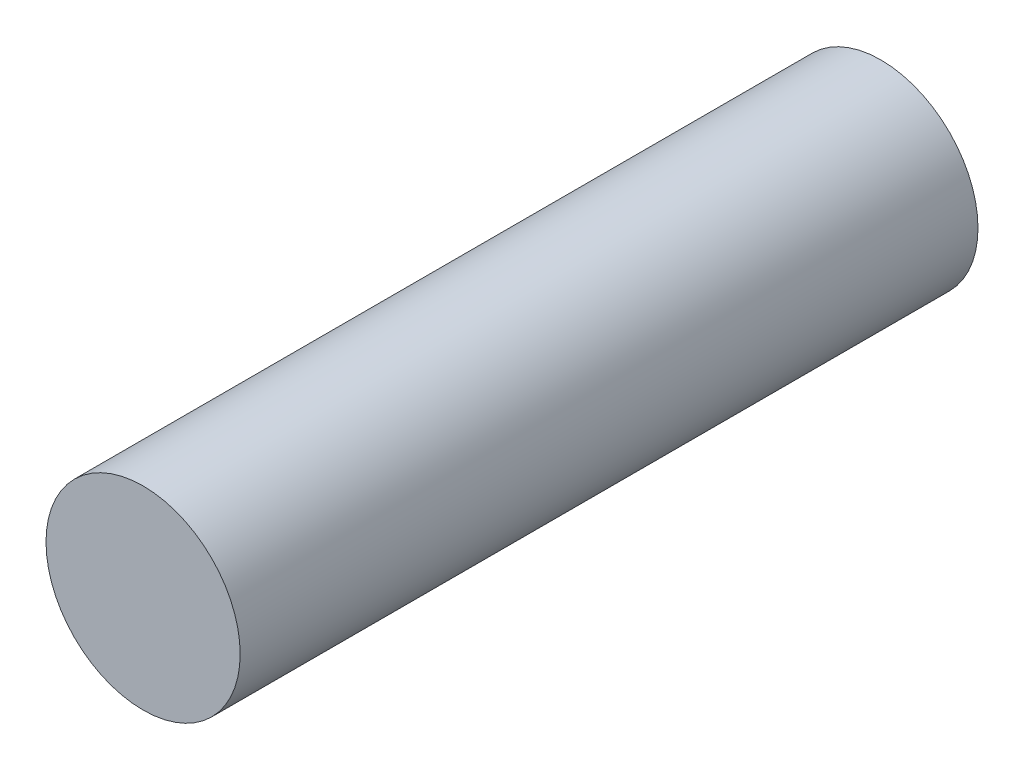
from build123d import *

# Parameters (mm, degrees)
ESQUISSE1_R      = 12.5
EXTRUSION1_DEPTH = 95


with BuildPart() as part:
    # Esquisse1 → Extrusion1 (new body)
    with BuildSketch(Plane.XY):
        Circle(ESQUISSE1_R)
    extrude(amount=EXTRUSION1_DEPTH)


solid = part.part
